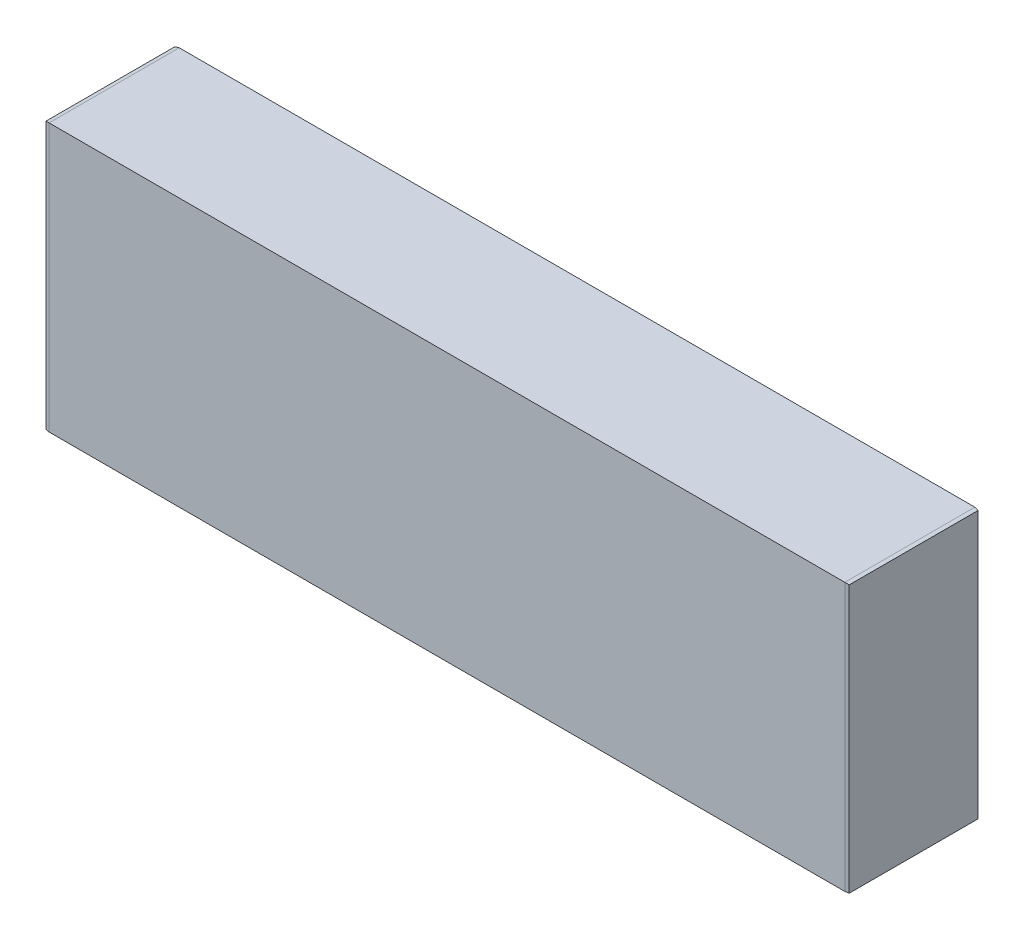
from build123d import *
from OCP.BRepFilletAPI import BRepFilletAPI_MakeChamfer

# Parameters (mm, degrees)
SKETCH1_W           = 213
SKETCH1_H           = 71
BOSS_EXTRUDE1_DEPTH = 34.5
CHAMFER1_SIZE       = 1
CHAMFER1_SIZE2      = 0.176326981
CHAMFER2_SIZE       = 1
CHAMFER2_SIZE2      = 0.176326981
SKETCH3_W           = 24.147346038
SKETCH3_H           = 16.197572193
SKETCH3_W_2         = 4
SKETCH3_H_2         = 13.380603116
CUT_EXTRUDE2_DEPTH  = 1
SKETCH4_W           = 6
SKETCH4_H           = 1
CUT_EXTRUDE3_DEPTH  = 1


with BuildPart() as part:
    # Sketch1 → Boss-Extrude1 (new body)
    with BuildSketch(Plane.XY):
        with Locations((61.169898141, -8.554853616)):
            Rectangle(SKETCH1_W, SKETCH1_H)
    extrude(amount=BOSS_EXTRUDE1_DEPTH)

    # Chamfer1: one chamfer whose edges measure the first distance from different faces: ONE call of the kernel's chamfer builder (chamfer() names one face for all edges)
    chamfer1_edges_1 = [part.edges().sort_by_distance(p)[0] for p in [
        (-45.330101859, -8.554853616, 34.5),
    ]]
    chamfer1_side_1 = [part.faces().sort_by_distance(p)[0] for p in [
        (61.169898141, -8.554853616, 34.5),
    ]]
    chamfer1_edges_2 = [part.edges().sort_by_distance(p)[0] for p in [
        (-45.330101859, -8.554853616, 0),
    ]]
    chamfer1_side_2 = [part.faces().sort_by_distance(p)[0] for p in [
        (61.169898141, -8.554853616, 0),
    ]]
    chamfer1_edges_3 = [part.edges().sort_by_distance(p)[0] for p in [
        (-45.330101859, 26.945146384, 17.25),
    ]]
    chamfer1_side_3 = [part.faces().sort_by_distance(p)[0] for p in [
        (61.169898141, 26.945146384, 17.25),
    ]]
    chamfer1 = BRepFilletAPI_MakeChamfer(part.part.solid().wrapped)
    for e in chamfer1_edges_1:
        chamfer1.Add(CHAMFER1_SIZE, CHAMFER1_SIZE2, e.wrapped, chamfer1_side_1[0].wrapped)  # the first distance lies on this face
    for e in chamfer1_edges_2:
        chamfer1.Add(CHAMFER1_SIZE, CHAMFER1_SIZE2, e.wrapped, chamfer1_side_2[0].wrapped)  # the first distance lies on this face
    for e in chamfer1_edges_3:
        chamfer1.Add(CHAMFER1_SIZE, CHAMFER1_SIZE2, e.wrapped, chamfer1_side_3[0].wrapped)  # the first distance lies on this face
    add(Compound.cast(chamfer1.Shape()), mode=Mode.REPLACE)

    # Chamfer2: one chamfer whose edges measure the first distance from different faces: ONE call of the kernel's chamfer builder (chamfer() names one face for all edges)
    chamfer2_edges_1 = [part.edges().sort_by_distance(p)[0] for p in [
        (167.669898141, -8.554853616, 34.5),
    ]]
    chamfer2_side_1 = [part.faces().sort_by_distance(p)[0] for p in [
        (61.669898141, -8.554853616, 34.5),
    ]]
    chamfer2_edges_2 = [part.edges().sort_by_distance(p)[0] for p in [
        (167.669898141, -8.554853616, 0),
    ]]
    chamfer2_side_2 = [part.faces().sort_by_distance(p)[0] for p in [
        (61.669898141, -8.554853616, 0),
    ]]
    chamfer2_edges_3 = [part.edges().sort_by_distance(p)[0] for p in [
        (167.669898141, 26.945146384, 17.25),
    ]]
    chamfer2_side_3 = [part.faces().sort_by_distance(p)[0] for p in [
        (61.669898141, 26.945146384, 17.25),
    ]]
    chamfer2 = BRepFilletAPI_MakeChamfer(part.part.solid().wrapped)
    for e in chamfer2_edges_1:
        chamfer2.Add(CHAMFER2_SIZE, CHAMFER2_SIZE2, e.wrapped, chamfer2_side_1[0].wrapped)  # the first distance lies on this face
    for e in chamfer2_edges_2:
        chamfer2.Add(CHAMFER2_SIZE, CHAMFER2_SIZE2, e.wrapped, chamfer2_side_2[0].wrapped)  # the first distance lies on this face
    for e in chamfer2_edges_3:
        chamfer2.Add(CHAMFER2_SIZE, CHAMFER2_SIZE2, e.wrapped, chamfer2_side_3[0].wrapped)  # the first distance lies on this face
    add(Compound.cast(chamfer2.Shape()), mode=Mode.REPLACE)

    # Sketch3 → Cut-Extrude2 (cut)
    with BuildSketch(Plane.ZY.offset(45.330101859)):
        with Locations((17.25, -25.758486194)):
            Rectangle(SKETCH3_W, SKETCH3_H)
        with Locations((8.805796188, -25.859092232)):
            Rectangle(SKETCH3_W_2, SKETCH3_H_2, mode=Mode.SUBTRACT)
        with Locations((14.435265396, -25.859092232)):
            Rectangle(SKETCH3_W_2, SKETCH3_H_2, mode=Mode.SUBTRACT)
        with Locations((20.064734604, -25.859092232)):
            Rectangle(SKETCH3_W_2, SKETCH3_H_2, mode=Mode.SUBTRACT)
        with Locations((25.694203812, -25.859092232)):
            Rectangle(SKETCH3_W_2, SKETCH3_H_2, mode=Mode.SUBTRACT)
    extrude(amount=-CUT_EXTRUDE2_DEPTH, mode=Mode.SUBTRACT)

    # Sketch4 → Cut-Extrude3 (cut)
    with BuildSketch(Plane.ZY.offset(45.330101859)):
        Polygon((8.176326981, -35.85727229), (9.176326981, -35.85727229), (9.176326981, -38.35727229), (11.676326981, -38.35727229), (11.676326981, -39.35727229), (9.176326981, -39.35727229), (9.176326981, -41.85727229), (8.176326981, -41.85727229), (8.176326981, -39.35727229), (5.676326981, -39.35727229), (5.676326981, -38.35727229), (8.176326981, -38.35727229), align=None)
        with Locations((25.720428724, -38.85727229)):
            Rectangle(SKETCH4_W, SKETCH4_H)
    extrude(amount=-CUT_EXTRUDE3_DEPTH, mode=Mode.SUBTRACT)


solid = part.part
